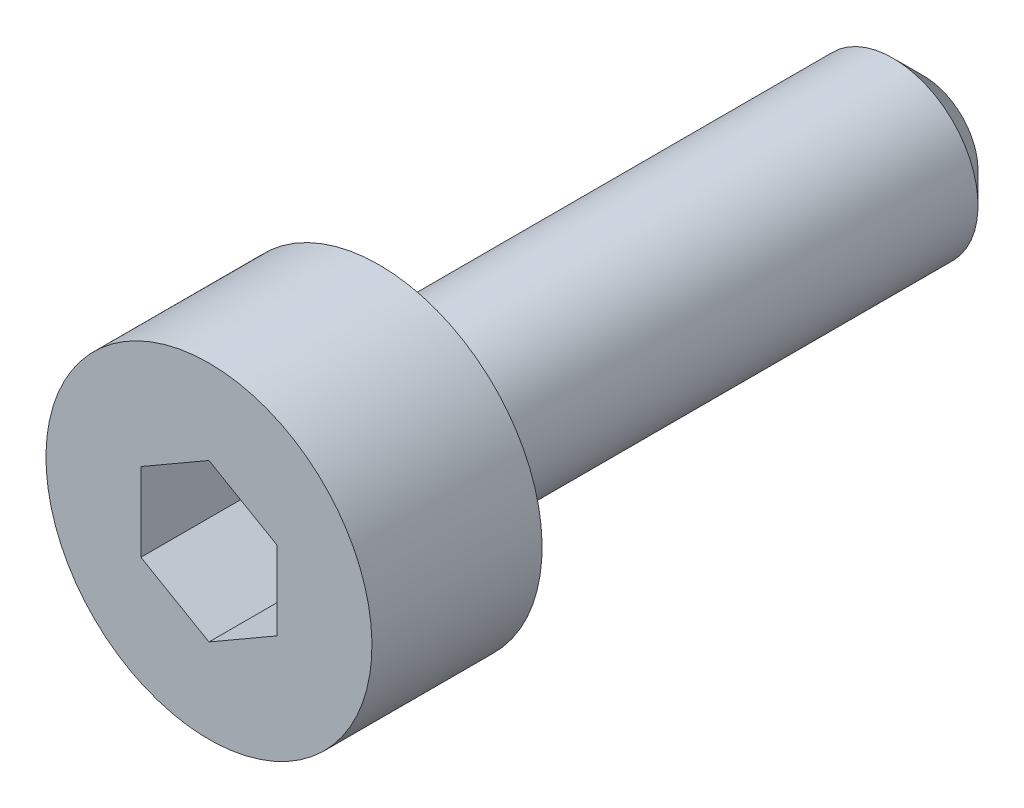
ISO-10303-21;
HEADER;
FILE_DESCRIPTION(('STEP AP214'),'2;1');
FILE_NAME('part.step','',(''),(''),'','','');
FILE_SCHEMA(('AUTOMOTIVE_DESIGN { 1 0 10303 214 1 1 1 1 }'));
ENDSEC;
DATA;
#1=APPLICATION_CONTEXT('core data for automotive mechanical design processes');
#2=APPLICATION_PROTOCOL_DEFINITION('international standard','automotive_design',2000,#1);
#3=PRODUCT_CONTEXT('',#1,'mechanical');
#4=PRODUCT('Part','Part','',(#3));
#5=PRODUCT_RELATED_PRODUCT_CATEGORY('part','',(#4));
#6=PRODUCT_DEFINITION_FORMATION('','',#4);
#7=PRODUCT_DEFINITION_CONTEXT('part definition',#1,'design');
#8=PRODUCT_DEFINITION('design','',#6,#7);
#9=PRODUCT_DEFINITION_SHAPE('','',#8);
#10=(LENGTH_UNIT() NAMED_UNIT(*) SI_UNIT(.MILLI.,.METRE.));
#11=(NAMED_UNIT(*) PLANE_ANGLE_UNIT() SI_UNIT($,.RADIAN.));
#12=(NAMED_UNIT(*) SI_UNIT($,.STERADIAN.) SOLID_ANGLE_UNIT());
#13=UNCERTAINTY_MEASURE_WITH_UNIT(LENGTH_MEASURE(1.E-05),#10,'distance_accuracy_value','');
#14=(GEOMETRIC_REPRESENTATION_CONTEXT(3) GLOBAL_UNCERTAINTY_ASSIGNED_CONTEXT((#13)) GLOBAL_UNIT_ASSIGNED_CONTEXT((#10,
#11,#12)) REPRESENTATION_CONTEXT('',''));
#15=CARTESIAN_POINT('',(0.,0.,0.));
#16=DIRECTION('',(0.,0.,1.));
#17=DIRECTION('',(1.,0.,0.));
#18=AXIS2_PLACEMENT_3D('',#15,#16,#17);
#19=CARTESIAN_POINT('',(0.,0.,0.));
#20=DIRECTION('',(0.,0.,1.));
#21=DIRECTION('',(0.866025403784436,-0.5,0.));
#22=AXIS2_PLACEMENT_3D('',#19,#20,#21);
#23=PLANE('',#22);
#24=CARTESIAN_POINT('',(0.,0.,0.));
#25=DIRECTION('',(0.,0.,1.));
#26=DIRECTION('',(0.866025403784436,-0.5,0.));
#27=AXIS2_PLACEMENT_3D('',#24,#25,#26);
#28=CIRCLE('',#27,2.395);
#29=CARTESIAN_POINT('',(2.07413084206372,-1.1975,0.));
#30=VERTEX_POINT('',#29);
#31=EDGE_CURVE('E119',#30,#30,#28,.T.);
#32=ORIENTED_EDGE('',*,*,#31,.F.);
#33=EDGE_LOOP('',(#32));
#34=FACE_BOUND('',#33,.T.);
#35=CARTESIAN_POINT('',(0.,0.,0.));
#36=DIRECTION('',(0.,0.,1.));
#37=DIRECTION('',(0.866025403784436,-0.5,0.));
#38=AXIS2_PLACEMENT_3D('',#35,#36,#37);
#39=CIRCLE('',#38,1.25);
#40=CARTESIAN_POINT('',(1.08253175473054,-0.625,0.));
#41=VERTEX_POINT('',#40);
#42=EDGE_CURVE('E131',#41,#41,#39,.F.);
#43=ORIENTED_EDGE('',*,*,#42,.F.);
#44=EDGE_LOOP('',(#43));
#45=FACE_BOUND('',#44,.T.);
#46=ADVANCED_FACE('F16',(#34,#45),#23,.F.);
#47=CARTESIAN_POINT('',(0.,0.,2.5));
#48=DIRECTION('',(0.,0.,-1.));
#49=DIRECTION('',(-0.866025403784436,0.5,0.));
#50=AXIS2_PLACEMENT_3D('',#47,#48,#49);
#51=CYLINDRICAL_SURFACE('',#50,2.395);
#52=CARTESIAN_POINT('',(0.,0.,2.5));
#53=DIRECTION('',(0.,0.,1.));
#54=DIRECTION('',(0.866025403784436,-0.5,0.));
#55=AXIS2_PLACEMENT_3D('',#52,#53,#54);
#56=CIRCLE('',#55,2.395);
#57=CARTESIAN_POINT('',(2.07413084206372,-1.1975,2.5));
#58=VERTEX_POINT('',#57);
#59=EDGE_CURVE('E128',#58,#58,#56,.T.);
#60=ORIENTED_EDGE('',*,*,#59,.F.);
#61=EDGE_LOOP('',(#60));
#62=FACE_BOUND('',#61,.T.);
#63=ORIENTED_EDGE('',*,*,#31,.T.);
#64=EDGE_LOOP('',(#63));
#65=FACE_BOUND('',#64,.T.);
#66=ADVANCED_FACE('F150',(#62,#65),#51,.T.);
#67=CARTESIAN_POINT('',(0.,0.,2.5));
#68=DIRECTION('',(0.,0.,1.));
#69=DIRECTION('',(0.866025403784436,-0.5,0.));
#70=AXIS2_PLACEMENT_3D('',#67,#68,#69);
#71=PLANE('',#70);
#72=DIRECTION('',(0.,1.,0.));
#73=VECTOR('',#72,1.);
#74=CARTESIAN_POINT('',(1.,0.57735026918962,2.5));
#75=LINE('',#74,#73);
#76=CARTESIAN_POINT('',(1.,-0.577350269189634,2.5));
#77=VERTEX_POINT('',#76);
#78=CARTESIAN_POINT('',(1.,0.57735026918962,2.5));
#79=VERTEX_POINT('',#78);
#80=EDGE_CURVE('E31',#77,#79,#75,.T.);
#81=ORIENTED_EDGE('',*,*,#80,.F.);
#82=DIRECTION('',(0.866025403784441,0.499999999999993,0.));
#83=VECTOR('',#82,1.);
#84=CARTESIAN_POINT('',(0.,-1.15470053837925,2.5));
#85=LINE('',#84,#83);
#86=CARTESIAN_POINT('',(0.,-1.15470053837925,2.5));
#87=VERTEX_POINT('',#86);
#88=EDGE_CURVE('E101',#87,#77,#85,.T.);
#89=ORIENTED_EDGE('',*,*,#88,.F.);
#90=DIRECTION('',(0.866025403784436,-0.5,0.));
#91=VECTOR('',#90,1.);
#92=CARTESIAN_POINT('',(-1.,-0.577350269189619,2.5));
#93=LINE('',#92,#91);
#94=CARTESIAN_POINT('',(-1.,-0.577350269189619,2.5));
#95=VERTEX_POINT('',#94);
#96=EDGE_CURVE('E95',#95,#87,#93,.T.);
#97=ORIENTED_EDGE('',*,*,#96,.F.);
#98=DIRECTION('',(0.,-1.,0.));
#99=VECTOR('',#98,1.);
#100=CARTESIAN_POINT('',(-1.,-0.577350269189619,2.5));
#101=LINE('',#100,#99);
#102=CARTESIAN_POINT('',(-1.,0.577350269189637,2.5));
#103=VERTEX_POINT('',#102);
#104=EDGE_CURVE('E93',#103,#95,#101,.T.);
#105=ORIENTED_EDGE('',*,*,#104,.F.);
#106=DIRECTION('',(-0.866025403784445,-0.499999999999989,0.));
#107=VECTOR('',#106,1.);
#108=CARTESIAN_POINT('',(0.,1.15470053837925,2.5));
#109=LINE('',#108,#107);
#110=CARTESIAN_POINT('',(0.,1.15470053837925,2.5));
#111=VERTEX_POINT('',#110);
#112=EDGE_CURVE('E74',#111,#103,#109,.T.);
#113=ORIENTED_EDGE('',*,*,#112,.F.);
#114=DIRECTION('',(-0.866025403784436,0.5,0.));
#115=VECTOR('',#114,1.);
#116=CARTESIAN_POINT('',(0.,1.15470053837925,2.5));
#117=LINE('',#116,#115);
#118=EDGE_CURVE('E85',#79,#111,#117,.T.);
#119=ORIENTED_EDGE('',*,*,#118,.F.);
#120=EDGE_LOOP('',(#81,#89,#97,#105,#113,#119));
#121=FACE_BOUND('',#120,.T.);
#122=ORIENTED_EDGE('',*,*,#59,.T.);
#123=EDGE_LOOP('',(#122));
#124=FACE_BOUND('',#123,.T.);
#125=ADVANCED_FACE('F89',(#121,#124),#71,.T.);
#126=CARTESIAN_POINT('',(0.,0.,-8.));
#127=DIRECTION('',(0.,0.,1.));
#128=DIRECTION('',(0.866025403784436,-0.5,0.));
#129=AXIS2_PLACEMENT_3D('',#126,#127,#128);
#130=CYLINDRICAL_SURFACE('',#129,1.25);
#131=CARTESIAN_POINT('',(0.,0.,-7.55));
#132=DIRECTION('',(0.,0.,-1.));
#133=DIRECTION('',(-0.866025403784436,0.5,0.));
#134=AXIS2_PLACEMENT_3D('',#131,#132,#133);
#135=CIRCLE('',#134,1.25);
#136=CARTESIAN_POINT('',(-1.08253175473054,0.625,-7.55));
#137=VERTEX_POINT('',#136);
#138=EDGE_CURVE('E11',#137,#137,#135,.F.);
#139=ORIENTED_EDGE('',*,*,#138,.T.);
#140=EDGE_LOOP('',(#139));
#141=FACE_BOUND('',#140,.T.);
#142=ORIENTED_EDGE('',*,*,#42,.T.);
#143=EDGE_LOOP('',(#142));
#144=FACE_BOUND('',#143,.T.);
#145=ADVANCED_FACE('F162',(#141,#144),#130,.T.);
#146=CARTESIAN_POINT('',(0.,0.,-8.));
#147=DIRECTION('',(0.,0.,-1.));
#148=DIRECTION('',(-0.866025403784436,0.5,0.));
#149=AXIS2_PLACEMENT_3D('',#146,#147,#148);
#150=PLANE('',#149);
#151=CARTESIAN_POINT('',(0.,0.,-8.));
#152=DIRECTION('',(0.,0.,-1.));
#153=DIRECTION('',(-0.866025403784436,0.5,0.));
#154=AXIS2_PLACEMENT_3D('',#151,#152,#153);
#155=CIRCLE('',#154,0.8);
#156=CARTESIAN_POINT('',(-0.692820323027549,0.4,-8.));
#157=VERTEX_POINT('',#156);
#158=EDGE_CURVE('E24',#157,#157,#155,.T.);
#159=ORIENTED_EDGE('',*,*,#158,.T.);
#160=EDGE_LOOP('',(#159));
#161=FACE_BOUND('',#160,.T.);
#162=ADVANCED_FACE('F136',(#161),#150,.T.);
#163=CARTESIAN_POINT('',(1.,0.57735026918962,0.8));
#164=DIRECTION('',(1.,0.,0.));
#165=DIRECTION('',(0.,1.,0.));
#166=AXIS2_PLACEMENT_3D('',#163,#164,#165);
#167=PLANE('',#166);
#168=ORIENTED_EDGE('',*,*,#80,.T.);
#169=DIRECTION('',(0.,0.,1.));
#170=VECTOR('',#169,1.);
#171=CARTESIAN_POINT('',(1.,0.57735026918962,0.8));
#172=LINE('',#171,#170);
#173=CARTESIAN_POINT('',(1.,0.57735026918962,0.8));
#174=VERTEX_POINT('',#173);
#175=EDGE_CURVE('E82',#174,#79,#172,.T.);
#176=ORIENTED_EDGE('',*,*,#175,.F.);
#177=DIRECTION('',(0.,1.,0.));
#178=VECTOR('',#177,1.);
#179=CARTESIAN_POINT('',(1.,0.57735026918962,0.8));
#180=LINE('',#179,#178);
#181=CARTESIAN_POINT('',(1.,-0.577350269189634,0.8));
#182=VERTEX_POINT('',#181);
#183=EDGE_CURVE('E103',#182,#174,#180,.T.);
#184=ORIENTED_EDGE('',*,*,#183,.F.);
#185=DIRECTION('',(0.,0.,1.));
#186=VECTOR('',#185,1.);
#187=CARTESIAN_POINT('',(1.,-0.577350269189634,0.8));
#188=LINE('',#187,#186);
#189=EDGE_CURVE('E38',#182,#77,#188,.T.);
#190=ORIENTED_EDGE('',*,*,#189,.T.);
#191=EDGE_LOOP('',(#168,#176,#184,#190));
#192=FACE_BOUND('',#191,.T.);
#193=ADVANCED_FACE('F174',(#192),#167,.F.);
#194=CARTESIAN_POINT('',(0.,-1.15470053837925,0.8));
#195=DIRECTION('',(0.499999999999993,-0.866025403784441,0.));
#196=DIRECTION('',(0.866025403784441,0.499999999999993,0.));
#197=AXIS2_PLACEMENT_3D('',#194,#195,#196);
#198=PLANE('',#197);
#199=ORIENTED_EDGE('',*,*,#88,.T.);
#200=ORIENTED_EDGE('',*,*,#189,.F.);
#201=DIRECTION('',(0.866025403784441,0.499999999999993,0.));
#202=VECTOR('',#201,1.);
#203=CARTESIAN_POINT('',(0.,-1.15470053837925,0.8));
#204=LINE('',#203,#202);
#205=CARTESIAN_POINT('',(0.,-1.15470053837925,0.8));
#206=VERTEX_POINT('',#205);
#207=EDGE_CURVE('E115',#206,#182,#204,.T.);
#208=ORIENTED_EDGE('',*,*,#207,.F.);
#209=DIRECTION('',(0.,0.,1.));
#210=VECTOR('',#209,1.);
#211=CARTESIAN_POINT('',(0.,-1.15470053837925,0.8));
#212=LINE('',#211,#210);
#213=EDGE_CURVE('E120',#206,#87,#212,.T.);
#214=ORIENTED_EDGE('',*,*,#213,.T.);
#215=EDGE_LOOP('',(#199,#200,#208,#214));
#216=FACE_BOUND('',#215,.T.);
#217=ADVANCED_FACE('F181',(#216),#198,.F.);
#218=CARTESIAN_POINT('',(-1.,-0.577350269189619,0.8));
#219=DIRECTION('',(-0.5,-0.866025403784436,0.));
#220=DIRECTION('',(0.,0.,-1.));
#221=AXIS2_PLACEMENT_3D('',#218,#219,#220);
#222=PLANE('',#221);
#223=ORIENTED_EDGE('',*,*,#96,.T.);
#224=ORIENTED_EDGE('',*,*,#213,.F.);
#225=DIRECTION('',(0.866025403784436,-0.5,0.));
#226=VECTOR('',#225,1.);
#227=CARTESIAN_POINT('',(-1.,-0.577350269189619,0.8));
#228=LINE('',#227,#226);
#229=CARTESIAN_POINT('',(-1.,-0.577350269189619,0.8));
#230=VERTEX_POINT('',#229);
#231=EDGE_CURVE('E112',#230,#206,#228,.T.);
#232=ORIENTED_EDGE('',*,*,#231,.F.);
#233=DIRECTION('',(0.,0.,1.));
#234=VECTOR('',#233,1.);
#235=CARTESIAN_POINT('',(-1.,-0.577350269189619,0.8));
#236=LINE('',#235,#234);
#237=EDGE_CURVE('E122',#230,#95,#236,.T.);
#238=ORIENTED_EDGE('',*,*,#237,.T.);
#239=EDGE_LOOP('',(#223,#224,#232,#238));
#240=FACE_BOUND('',#239,.T.);
#241=ADVANCED_FACE('F191',(#240),#222,.F.);
#242=CARTESIAN_POINT('',(-1.,-0.577350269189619,0.8));
#243=DIRECTION('',(-1.,0.,0.));
#244=DIRECTION('',(0.,-1.,0.));
#245=AXIS2_PLACEMENT_3D('',#242,#243,#244);
#246=PLANE('',#245);
#247=ORIENTED_EDGE('',*,*,#104,.T.);
#248=ORIENTED_EDGE('',*,*,#237,.F.);
#249=DIRECTION('',(0.,-1.,0.));
#250=VECTOR('',#249,1.);
#251=CARTESIAN_POINT('',(-1.,-0.577350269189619,0.8));
#252=LINE('',#251,#250);
#253=CARTESIAN_POINT('',(-1.,0.577350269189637,0.8));
#254=VERTEX_POINT('',#253);
#255=EDGE_CURVE('E109',#254,#230,#252,.T.);
#256=ORIENTED_EDGE('',*,*,#255,.F.);
#257=DIRECTION('',(0.,0.,1.));
#258=VECTOR('',#257,1.);
#259=CARTESIAN_POINT('',(-1.,0.577350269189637,0.8));
#260=LINE('',#259,#258);
#261=EDGE_CURVE('E81',#254,#103,#260,.T.);
#262=ORIENTED_EDGE('',*,*,#261,.T.);
#263=EDGE_LOOP('',(#247,#248,#256,#262));
#264=FACE_BOUND('',#263,.T.);
#265=ADVANCED_FACE('F188',(#264),#246,.F.);
#266=CARTESIAN_POINT('',(0.,1.15470053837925,0.8));
#267=DIRECTION('',(-0.499999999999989,0.866025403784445,0.));
#268=DIRECTION('',(-0.866025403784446,-0.49999999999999,0.));
#269=AXIS2_PLACEMENT_3D('',#266,#267,#268);
#270=PLANE('',#269);
#271=ORIENTED_EDGE('',*,*,#112,.T.);
#272=ORIENTED_EDGE('',*,*,#261,.F.);
#273=DIRECTION('',(-0.866025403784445,-0.499999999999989,0.));
#274=VECTOR('',#273,1.);
#275=CARTESIAN_POINT('',(0.,1.15470053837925,0.8));
#276=LINE('',#275,#274);
#277=CARTESIAN_POINT('',(0.,1.15470053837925,0.8));
#278=VERTEX_POINT('',#277);
#279=EDGE_CURVE('E77',#278,#254,#276,.T.);
#280=ORIENTED_EDGE('',*,*,#279,.F.);
#281=DIRECTION('',(0.,0.,1.));
#282=VECTOR('',#281,1.);
#283=CARTESIAN_POINT('',(0.,1.15470053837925,0.8));
#284=LINE('',#283,#282);
#285=EDGE_CURVE('E70',#278,#111,#284,.T.);
#286=ORIENTED_EDGE('',*,*,#285,.T.);
#287=EDGE_LOOP('',(#271,#272,#280,#286));
#288=FACE_BOUND('',#287,.T.);
#289=ADVANCED_FACE('F72',(#288),#270,.F.);
#290=CARTESIAN_POINT('',(0.,1.15470053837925,0.8));
#291=DIRECTION('',(0.5,0.866025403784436,0.));
#292=DIRECTION('',(0.,0.,1.));
#293=AXIS2_PLACEMENT_3D('',#290,#291,#292);
#294=PLANE('',#293);
#295=ORIENTED_EDGE('',*,*,#118,.T.);
#296=ORIENTED_EDGE('',*,*,#285,.F.);
#297=DIRECTION('',(-0.866025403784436,0.5,0.));
#298=VECTOR('',#297,1.);
#299=CARTESIAN_POINT('',(0.,1.15470053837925,0.8));
#300=LINE('',#299,#298);
#301=EDGE_CURVE('E106',#174,#278,#300,.T.);
#302=ORIENTED_EDGE('',*,*,#301,.F.);
#303=ORIENTED_EDGE('',*,*,#175,.T.);
#304=EDGE_LOOP('',(#295,#296,#302,#303));
#305=FACE_BOUND('',#304,.T.);
#306=ADVANCED_FACE('F86',(#305),#294,.F.);
#307=CARTESIAN_POINT('',(1.00000000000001,1.73205080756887,0.8));
#308=DIRECTION('',(0.,0.,-1.));
#309=DIRECTION('',(-0.866025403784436,0.5,0.));
#310=AXIS2_PLACEMENT_3D('',#307,#308,#309);
#311=PLANE('',#310);
#312=ORIENTED_EDGE('',*,*,#183,.T.);
#313=ORIENTED_EDGE('',*,*,#301,.T.);
#314=ORIENTED_EDGE('',*,*,#279,.T.);
#315=ORIENTED_EDGE('',*,*,#255,.T.);
#316=ORIENTED_EDGE('',*,*,#231,.T.);
#317=ORIENTED_EDGE('',*,*,#207,.T.);
#318=EDGE_LOOP('',(#312,#313,#314,#315,#316,#317));
#319=FACE_BOUND('',#318,.T.);
#320=ADVANCED_FACE('F139',(#319),#311,.F.);
#321=CARTESIAN_POINT('',(0.,0.,-8.));
#322=DIRECTION('',(0.,0.,1.));
#323=DIRECTION('',(0.866025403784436,-0.5,0.));
#324=AXIS2_PLACEMENT_3D('',#321,#322,#323);
#325=CONICAL_SURFACE('',#324,0.8,0.785398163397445);
#326=ORIENTED_EDGE('',*,*,#138,.F.);
#327=EDGE_LOOP('',(#326));
#328=FACE_BOUND('',#327,.T.);
#329=ORIENTED_EDGE('',*,*,#158,.F.);
#330=EDGE_LOOP('',(#329));
#331=FACE_BOUND('',#330,.T.);
#332=ADVANCED_FACE('F18',(#328,#331),#325,.T.);
#333=CLOSED_SHELL('',(#46,#66,#125,#145,#162,#193,#217,#241,#265,#289,#306,#320,#332));
#334=MANIFOLD_SOLID_BREP('B1',#333);
#335=ADVANCED_BREP_SHAPE_REPRESENTATION('',(#18,#334),#14);
#336=SHAPE_DEFINITION_REPRESENTATION(#9,#335);
ENDSEC;
END-ISO-10303-21;
